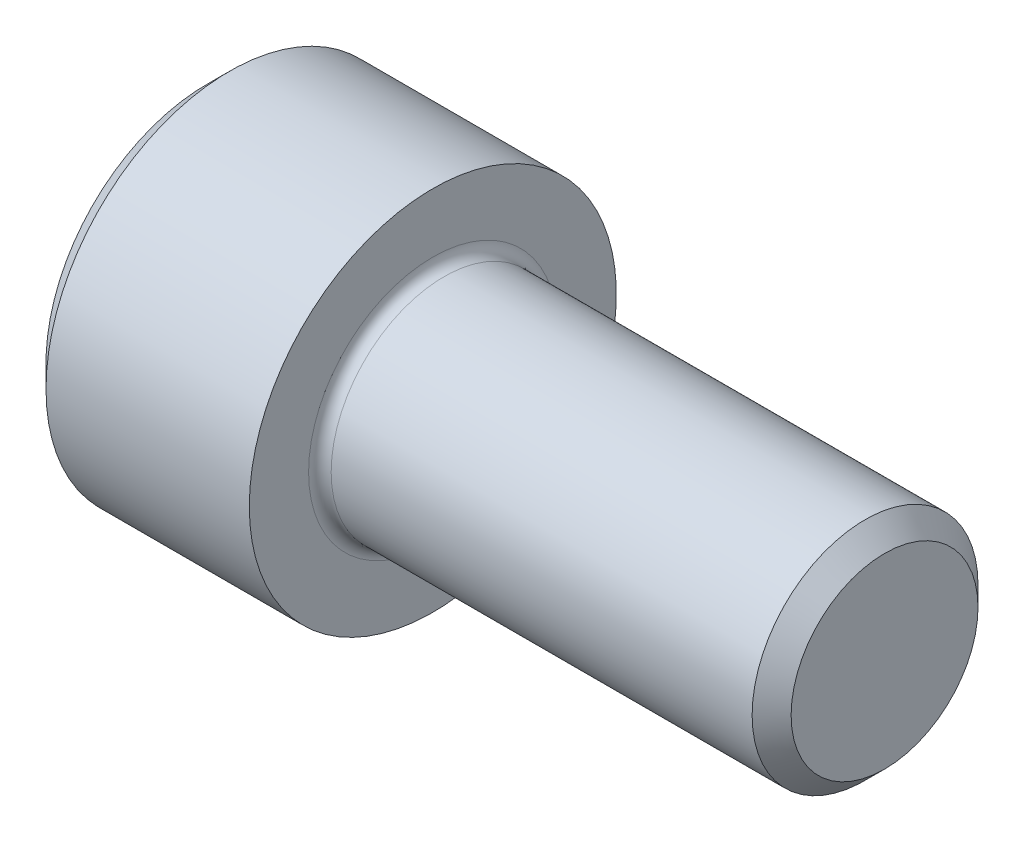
ISO-10303-21;
HEADER;
FILE_DESCRIPTION(('STEP AP214'),'2;1');
FILE_NAME('part.step','',(''),(''),'','','');
FILE_SCHEMA(('AUTOMOTIVE_DESIGN { 1 0 10303 214 1 1 1 1 }'));
ENDSEC;
DATA;
#1=APPLICATION_CONTEXT('core data for automotive mechanical design processes');
#2=APPLICATION_PROTOCOL_DEFINITION('international standard','automotive_design',2000,#1);
#3=PRODUCT_CONTEXT('',#1,'mechanical');
#4=PRODUCT('Part','Part','',(#3));
#5=PRODUCT_RELATED_PRODUCT_CATEGORY('part','',(#4));
#6=PRODUCT_DEFINITION_FORMATION('','',#4);
#7=PRODUCT_DEFINITION_CONTEXT('part definition',#1,'design');
#8=PRODUCT_DEFINITION('design','',#6,#7);
#9=PRODUCT_DEFINITION_SHAPE('','',#8);
#10=(LENGTH_UNIT() NAMED_UNIT(*) SI_UNIT(.MILLI.,.METRE.));
#11=(NAMED_UNIT(*) PLANE_ANGLE_UNIT() SI_UNIT($,.RADIAN.));
#12=(NAMED_UNIT(*) SI_UNIT($,.STERADIAN.) SOLID_ANGLE_UNIT());
#13=UNCERTAINTY_MEASURE_WITH_UNIT(LENGTH_MEASURE(1.E-05),#10,'distance_accuracy_value','');
#14=(GEOMETRIC_REPRESENTATION_CONTEXT(3) GLOBAL_UNCERTAINTY_ASSIGNED_CONTEXT((#13)) GLOBAL_UNIT_ASSIGNED_CONTEXT((#10,
#11,#12)) REPRESENTATION_CONTEXT('',''));
#15=CARTESIAN_POINT('',(0.,0.,0.));
#16=DIRECTION('',(0.,0.,1.));
#17=DIRECTION('',(1.,0.,0.));
#18=AXIS2_PLACEMENT_3D('',#15,#16,#17);
#19=CARTESIAN_POINT('',(24.,-3.349214,3.349214));
#20=DIRECTION('',(1.,0.,0.));
#21=DIRECTION('',(0.,0.,-1.));
#22=AXIS2_PLACEMENT_3D('',#19,#20,#21);
#23=PLANE('',#22);
#24=CARTESIAN_POINT('',(24.,0.,0.));
#25=DIRECTION('',(-1.,0.,0.));
#26=DIRECTION('',(0.,0.,1.));
#27=AXIS2_PLACEMENT_3D('',#24,#25,#26);
#28=CIRCLE('',#27,3.30949999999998);
#29=CARTESIAN_POINT('',(24.,0.,3.30949999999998));
#30=VERTEX_POINT('',#29);
#31=EDGE_CURVE('E20',#30,#30,#28,.F.);
#32=ORIENTED_EDGE('',*,*,#31,.T.);
#33=EDGE_LOOP('',(#32));
#34=FACE_BOUND('',#33,.T.);
#35=ADVANCED_FACE('F16',(#34),#23,.T.);
#36=CARTESIAN_POINT('',(24.,0.,0.));
#37=DIRECTION('',(-1.,0.,0.));
#38=DIRECTION('',(0.,0.,1.));
#39=AXIS2_PLACEMENT_3D('',#36,#37,#38);
#40=CONICAL_SURFACE('',#39,3.3095,0.785398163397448);
#41=CARTESIAN_POINT('',(23.3095,0.,0.));
#42=DIRECTION('',(-1.,0.,0.));
#43=DIRECTION('',(0.,0.,1.));
#44=AXIS2_PLACEMENT_3D('',#41,#42,#43);
#45=CIRCLE('',#44,4.);
#46=CARTESIAN_POINT('',(23.3095,0.,4.));
#47=VERTEX_POINT('',#46);
#48=EDGE_CURVE('E124',#47,#47,#45,.F.);
#49=ORIENTED_EDGE('',*,*,#48,.T.);
#50=EDGE_LOOP('',(#49));
#51=FACE_BOUND('',#50,.T.);
#52=ORIENTED_EDGE('',*,*,#31,.F.);
#53=EDGE_LOOP('',(#52));
#54=FACE_BOUND('',#53,.T.);
#55=ADVANCED_FACE('F254',(#51,#54),#40,.T.);
#56=CARTESIAN_POINT('',(23.3095,0.,0.));
#57=DIRECTION('',(-1.,0.,0.));
#58=DIRECTION('',(0.,0.,1.));
#59=AXIS2_PLACEMENT_3D('',#56,#57,#58);
#60=CYLINDRICAL_SURFACE('',#59,4.);
#61=CARTESIAN_POINT('',(8.40000000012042,0.,0.));
#62=DIRECTION('',(1.,0.,0.));
#63=DIRECTION('',(0.,0.,-1.));
#64=AXIS2_PLACEMENT_3D('',#61,#62,#63);
#65=CIRCLE('',#64,4.00000000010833);
#66=CARTESIAN_POINT('',(8.40000000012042,0.,-4.00000000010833));
#67=VERTEX_POINT('',#66);
#68=EDGE_CURVE('E120',#67,#67,#65,.T.);
#69=ORIENTED_EDGE('',*,*,#68,.T.);
#70=EDGE_LOOP('',(#69));
#71=FACE_BOUND('',#70,.T.);
#72=ORIENTED_EDGE('',*,*,#48,.F.);
#73=EDGE_LOOP('',(#72));
#74=FACE_BOUND('',#73,.T.);
#75=ADVANCED_FACE('F250',(#71,#74),#60,.T.);
#76=CARTESIAN_POINT('',(8.40000000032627,0.,0.));
#77=DIRECTION('',(1.,0.,0.));
#78=DIRECTION('',(0.,0.,-1.));
#79=AXIS2_PLACEMENT_3D('',#76,#77,#78);
#80=TOROIDAL_SURFACE('',#79,4.40000000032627,0.400000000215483);
#81=ORIENTED_EDGE('',*,*,#68,.F.);
#82=EDGE_LOOP('',(#81));
#83=FACE_BOUND('',#82,.T.);
#84=CARTESIAN_POINT('',(8.00000000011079,0.,0.));
#85=DIRECTION('',(1.,0.,0.));
#86=DIRECTION('',(0.,0.,-1.));
#87=AXIS2_PLACEMENT_3D('',#84,#85,#86);
#88=CIRCLE('',#87,4.400000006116);
#89=CARTESIAN_POINT('',(8.00000000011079,0.,-4.400000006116));
#90=VERTEX_POINT('',#89);
#91=EDGE_CURVE('E118',#90,#90,#88,.F.);
#92=ORIENTED_EDGE('',*,*,#91,.F.);
#93=EDGE_LOOP('',(#92));
#94=FACE_BOUND('',#93,.T.);
#95=ADVANCED_FACE('F253',(#83,#94),#80,.F.);
#96=CARTESIAN_POINT('',(8.,-6.578,6.578));
#97=DIRECTION('',(1.,0.,0.));
#98=DIRECTION('',(0.,0.,-1.));
#99=AXIS2_PLACEMENT_3D('',#96,#97,#98);
#100=PLANE('',#99);
#101=ORIENTED_EDGE('',*,*,#91,.T.);
#102=EDGE_LOOP('',(#101));
#103=FACE_BOUND('',#102,.T.);
#104=CARTESIAN_POINT('',(8.,0.,0.));
#105=DIRECTION('',(-1.,0.,0.));
#106=DIRECTION('',(0.,0.,1.));
#107=AXIS2_PLACEMENT_3D('',#104,#105,#106);
#108=CIRCLE('',#107,6.5);
#109=CARTESIAN_POINT('',(8.,0.,6.5));
#110=VERTEX_POINT('',#109);
#111=EDGE_CURVE('E116',#110,#110,#108,.F.);
#112=ORIENTED_EDGE('',*,*,#111,.T.);
#113=EDGE_LOOP('',(#112));
#114=FACE_BOUND('',#113,.T.);
#115=ADVANCED_FACE('F248',(#103,#114),#100,.T.);
#116=CARTESIAN_POINT('',(8.,0.,0.));
#117=DIRECTION('',(-1.,0.,0.));
#118=DIRECTION('',(0.,0.,1.));
#119=AXIS2_PLACEMENT_3D('',#116,#117,#118);
#120=CYLINDRICAL_SURFACE('',#119,6.5);
#121=CARTESIAN_POINT('',(0.799999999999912,0.,0.));
#122=DIRECTION('',(1.,0.,0.));
#123=DIRECTION('',(0.,0.,-1.));
#124=AXIS2_PLACEMENT_3D('',#121,#122,#123);
#125=CIRCLE('',#124,6.5);
#126=CARTESIAN_POINT('',(0.8,0.,-6.5));
#127=VERTEX_POINT('',#126);
#128=EDGE_CURVE('E93',#127,#127,#125,.T.);
#129=ORIENTED_EDGE('',*,*,#128,.T.);
#130=EDGE_LOOP('',(#129));
#131=FACE_BOUND('',#130,.T.);
#132=ORIENTED_EDGE('',*,*,#111,.F.);
#133=EDGE_LOOP('',(#132));
#134=FACE_BOUND('',#133,.T.);
#135=ADVANCED_FACE('F244',(#131,#134),#120,.T.);
#136=CARTESIAN_POINT('',(0.,0.,0.));
#137=DIRECTION('',(1.,0.,0.));
#138=DIRECTION('',(0.,0.,-1.));
#139=AXIS2_PLACEMENT_3D('',#136,#137,#138);
#140=CONICAL_SURFACE('',#139,5.7,0.785398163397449);
#141=ORIENTED_EDGE('',*,*,#128,.F.);
#142=EDGE_LOOP('',(#141));
#143=FACE_BOUND('',#142,.T.);
#144=CARTESIAN_POINT('',(0.,0.,0.));
#145=DIRECTION('',(1.,0.,0.));
#146=DIRECTION('',(0.,0.,-1.));
#147=AXIS2_PLACEMENT_3D('',#144,#145,#146);
#148=CIRCLE('',#147,5.7);
#149=CARTESIAN_POINT('',(0.,0.,-5.7));
#150=VERTEX_POINT('',#149);
#151=EDGE_CURVE('E92',#150,#150,#148,.F.);
#152=ORIENTED_EDGE('',*,*,#151,.F.);
#153=EDGE_LOOP('',(#152));
#154=FACE_BOUND('',#153,.T.);
#155=ADVANCED_FACE('F241',(#143,#154),#140,.T.);
#156=CARTESIAN_POINT('',(0.,1.759474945,-3.0475));
#157=DIRECTION('',(0.,0.866025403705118,-0.500000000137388));
#158=DIRECTION('',(0.,0.500000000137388,0.866025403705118));
#159=AXIS2_PLACEMENT_3D('',#156,#157,#158);
#160=PLANE('',#159);
#161=DIRECTION('',(1.,0.,0.));
#162=VECTOR('',#161,1.);
#163=CARTESIAN_POINT('',(2.,1.759474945,-3.0475));
#164=LINE('',#163,#162);
#165=CARTESIAN_POINT('',(0.,1.75947494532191,-3.0475));
#166=VERTEX_POINT('',#165);
#167=CARTESIAN_POINT('',(4.,1.759474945,-3.0475));
#168=VERTEX_POINT('',#167);
#169=EDGE_CURVE('E159',#166,#168,#164,.T.);
#170=ORIENTED_EDGE('',*,*,#169,.T.);
#171=DIRECTION('',(0.,0.500000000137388,0.866025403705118));
#172=VECTOR('',#171,1.);
#173=CARTESIAN_POINT('',(4.,1.759474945,-3.0475));
#174=LINE('',#173,#172);
#175=CARTESIAN_POINT('',(4.,2.63921241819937,-1.52374999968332));
#176=VERTEX_POINT('',#175);
#177=EDGE_CURVE('E157',#168,#176,#174,.T.);
#178=ORIENTED_EDGE('',*,*,#177,.T.);
#179=DIRECTION('',(0.,0.500000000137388,0.866025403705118));
#180=VECTOR('',#179,1.);
#181=CARTESIAN_POINT('',(4.,1.759474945,-3.0475));
#182=LINE('',#181,#180);
#183=CARTESIAN_POINT('',(4.,3.518949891,0.));
#184=VERTEX_POINT('',#183);
#185=EDGE_CURVE('E87',#176,#184,#182,.T.);
#186=ORIENTED_EDGE('',*,*,#185,.T.);
#187=DIRECTION('',(1.,0.,0.));
#188=VECTOR('',#187,1.);
#189=CARTESIAN_POINT('',(2.,3.518949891,0.));
#190=LINE('',#189,#188);
#191=CARTESIAN_POINT('',(0.,3.5189498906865,-4.93629063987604E-11));
#192=VERTEX_POINT('',#191);
#193=EDGE_CURVE('E80',#192,#184,#190,.T.);
#194=ORIENTED_EDGE('',*,*,#193,.F.);
#195=DIRECTION('',(0.,0.499999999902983,0.866025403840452));
#196=VECTOR('',#195,1.);
#197=CARTESIAN_POINT('',(0.,1.759474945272,-3.047500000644));
#198=LINE('',#197,#196);
#199=EDGE_CURVE('E84',#166,#192,#198,.T.);
#200=ORIENTED_EDGE('',*,*,#199,.F.);
#201=EDGE_LOOP('',(#170,#178,#186,#194,#200));
#202=FACE_BOUND('',#201,.T.);
#203=ADVANCED_FACE('F83',(#202),#160,.F.);
#204=CARTESIAN_POINT('',(0.,1.759474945,3.0475));
#205=DIRECTION('',(0.,-0.866025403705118,-0.500000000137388));
#206=DIRECTION('',(0.,0.500000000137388,-0.866025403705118));
#207=AXIS2_PLACEMENT_3D('',#204,#205,#206);
#208=PLANE('',#207);
#209=DIRECTION('',(0.,0.500000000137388,-0.866025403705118));
#210=VECTOR('',#209,1.);
#211=CARTESIAN_POINT('',(4.,1.759474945,3.0475));
#212=LINE('',#211,#210);
#213=CARTESIAN_POINT('',(4.,2.63921241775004,1.52375000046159));
#214=VERTEX_POINT('',#213);
#215=CARTESIAN_POINT('',(4.,1.759474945,3.0475));
#216=VERTEX_POINT('',#215);
#217=EDGE_CURVE('E105',#214,#216,#212,.F.);
#218=ORIENTED_EDGE('',*,*,#217,.T.);
#219=DIRECTION('',(-1.,0.,0.));
#220=VECTOR('',#219,1.);
#221=CARTESIAN_POINT('',(2.,1.759474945,3.0475));
#222=LINE('',#221,#220);
#223=CARTESIAN_POINT('',(0.,1.75947494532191,3.0475));
#224=VERTEX_POINT('',#223);
#225=EDGE_CURVE('E110',#216,#224,#222,.T.);
#226=ORIENTED_EDGE('',*,*,#225,.T.);
#227=DIRECTION('',(0.,-0.499999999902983,0.866025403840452));
#228=VECTOR('',#227,1.);
#229=CARTESIAN_POINT('',(0.,3.518949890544,0.));
#230=LINE('',#229,#228);
#231=EDGE_CURVE('E100',#192,#224,#230,.T.);
#232=ORIENTED_EDGE('',*,*,#231,.F.);
#233=ORIENTED_EDGE('',*,*,#193,.T.);
#234=DIRECTION('',(0.,0.500000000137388,-0.866025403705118));
#235=VECTOR('',#234,1.);
#236=CARTESIAN_POINT('',(4.,1.759474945,3.0475));
#237=LINE('',#236,#235);
#238=EDGE_CURVE('E160',#184,#214,#237,.F.);
#239=ORIENTED_EDGE('',*,*,#238,.T.);
#240=EDGE_LOOP('',(#218,#226,#232,#233,#239));
#241=FACE_BOUND('',#240,.T.);
#242=ADVANCED_FACE('F108',(#241),#208,.T.);
#243=CARTESIAN_POINT('',(0.,-5.7684,-5.7684));
#244=DIRECTION('',(-1.,0.,0.));
#245=DIRECTION('',(0.,0.,1.));
#246=AXIS2_PLACEMENT_3D('',#243,#244,#245);
#247=PLANE('',#246);
#248=DIRECTION('',(0.,1.,0.));
#249=VECTOR('',#248,1.);
#250=CARTESIAN_POINT('',(0.,0.,-3.0475));
#251=LINE('',#250,#249);
#252=CARTESIAN_POINT('',(0.,-1.759474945,-3.0475));
#253=VERTEX_POINT('',#252);
#254=EDGE_CURVE('E104',#253,#166,#251,.T.);
#255=ORIENTED_EDGE('',*,*,#254,.T.);
#256=ORIENTED_EDGE('',*,*,#199,.T.);
#257=ORIENTED_EDGE('',*,*,#231,.T.);
#258=DIRECTION('',(0.,-1.,0.));
#259=VECTOR('',#258,1.);
#260=CARTESIAN_POINT('',(0.,0.,3.0475));
#261=LINE('',#260,#259);
#262=CARTESIAN_POINT('',(0.,-1.759474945,3.0475));
#263=VERTEX_POINT('',#262);
#264=EDGE_CURVE('E172',#224,#263,#261,.T.);
#265=ORIENTED_EDGE('',*,*,#264,.T.);
#266=DIRECTION('',(0.,0.500000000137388,0.866025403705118));
#267=VECTOR('',#266,1.);
#268=CARTESIAN_POINT('',(0.,-2.639212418,1.52375));
#269=LINE('',#268,#267);
#270=CARTESIAN_POINT('',(0.,-3.518949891,0.));
#271=VERTEX_POINT('',#270);
#272=EDGE_CURVE('E198',#271,#263,#269,.T.);
#273=ORIENTED_EDGE('',*,*,#272,.F.);
#274=DIRECTION('',(0.,-0.500000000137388,0.866025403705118));
#275=VECTOR('',#274,1.);
#276=CARTESIAN_POINT('',(0.,-2.639212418,-1.52375));
#277=LINE('',#276,#275);
#278=EDGE_CURVE('E178',#253,#271,#277,.T.);
#279=ORIENTED_EDGE('',*,*,#278,.F.);
#280=EDGE_LOOP('',(#255,#256,#257,#265,#273,#279));
#281=FACE_BOUND('',#280,.T.);
#282=ORIENTED_EDGE('',*,*,#151,.T.);
#283=EDGE_LOOP('',(#282));
#284=FACE_BOUND('',#283,.T.);
#285=ADVANCED_FACE('F97',(#281,#284),#247,.T.);
#286=CARTESIAN_POINT('',(4.,-0.015835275,3.0475));
#287=DIRECTION('',(1.,0.,0.));
#288=DIRECTION('',(0.,0.,-1.));
#289=AXIS2_PLACEMENT_3D('',#286,#287,#288);
#290=PLANE('',#289);
#291=ORIENTED_EDGE('',*,*,#217,.F.);
#292=CARTESIAN_POINT('',(4.,0.,0.));
#293=DIRECTION('',(-1.,0.,0.));
#294=DIRECTION('',(0.,0.,1.));
#295=AXIS2_PLACEMENT_3D('',#292,#293,#294);
#296=CIRCLE('',#295,3.0475);
#297=CARTESIAN_POINT('',(4.,-2.73646157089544E-10,3.0475));
#298=VERTEX_POINT('',#297);
#299=EDGE_CURVE('E153',#298,#214,#296,.T.);
#300=ORIENTED_EDGE('',*,*,#299,.F.);
#301=DIRECTION('',(0.,1.,0.));
#302=VECTOR('',#301,1.);
#303=CARTESIAN_POINT('',(4.,0.,3.0475));
#304=LINE('',#303,#302);
#305=EDGE_CURVE('E169',#298,#216,#304,.T.);
#306=ORIENTED_EDGE('',*,*,#305,.T.);
#307=EDGE_LOOP('',(#291,#300,#306));
#308=FACE_BOUND('',#307,.T.);
#309=ADVANCED_FACE('F174',(#308),#290,.F.);
#310=CARTESIAN_POINT('',(4.,2.633933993,1.542035));
#311=DIRECTION('',(1.,0.,0.));
#312=DIRECTION('',(0.,0.,-1.));
#313=AXIS2_PLACEMENT_3D('',#310,#311,#312);
#314=PLANE('',#313);
#315=ORIENTED_EDGE('',*,*,#185,.F.);
#316=CARTESIAN_POINT('',(4.,0.,0.));
#317=DIRECTION('',(-1.,0.,0.));
#318=DIRECTION('',(0.,0.,1.));
#319=AXIS2_PLACEMENT_3D('',#316,#317,#318);
#320=CIRCLE('',#319,3.0475);
#321=EDGE_CURVE('E150',#214,#176,#320,.T.);
#322=ORIENTED_EDGE('',*,*,#321,.F.);
#323=ORIENTED_EDGE('',*,*,#238,.F.);
#324=EDGE_LOOP('',(#315,#322,#323));
#325=FACE_BOUND('',#324,.T.);
#326=ADVANCED_FACE('F221',(#325),#314,.F.);
#327=CARTESIAN_POINT('',(4.,-0.015835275,-1.5146075));
#328=DIRECTION('',(1.,0.,0.));
#329=DIRECTION('',(0.,0.,-1.));
#330=AXIS2_PLACEMENT_3D('',#327,#328,#329);
#331=PLANE('',#330);
#332=DIRECTION('',(0.,-1.,0.));
#333=VECTOR('',#332,1.);
#334=CARTESIAN_POINT('',(4.,0.,-3.0475));
#335=LINE('',#334,#333);
#336=CARTESIAN_POINT('',(4.,-6.2505282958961E-10,-3.0475));
#337=VERTEX_POINT('',#336);
#338=EDGE_CURVE('E189',#168,#337,#335,.T.);
#339=ORIENTED_EDGE('',*,*,#338,.T.);
#340=CARTESIAN_POINT('',(4.,0.,0.));
#341=DIRECTION('',(-1.,0.,0.));
#342=DIRECTION('',(0.,0.,1.));
#343=AXIS2_PLACEMENT_3D('',#340,#341,#342);
#344=CIRCLE('',#343,3.0475);
#345=EDGE_CURVE('E148',#176,#337,#344,.T.);
#346=ORIENTED_EDGE('',*,*,#345,.F.);
#347=ORIENTED_EDGE('',*,*,#177,.F.);
#348=EDGE_LOOP('',(#339,#346,#347));
#349=FACE_BOUND('',#348,.T.);
#350=ADVANCED_FACE('F217',(#349),#331,.F.);
#351=CARTESIAN_POINT('',(0.,-1.759474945,-3.0475));
#352=DIRECTION('',(0.,0.,-1.));
#353=DIRECTION('',(0.,1.,0.));
#354=AXIS2_PLACEMENT_3D('',#351,#352,#353);
#355=PLANE('',#354);
#356=DIRECTION('',(-1.,0.,0.));
#357=VECTOR('',#356,1.);
#358=CARTESIAN_POINT('',(2.,-1.759474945,-3.0475));
#359=LINE('',#358,#357);
#360=CARTESIAN_POINT('',(4.,-1.759474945,-3.0475));
#361=VERTEX_POINT('',#360);
#362=EDGE_CURVE('E175',#361,#253,#359,.T.);
#363=ORIENTED_EDGE('',*,*,#362,.F.);
#364=DIRECTION('',(0.,1.,0.));
#365=VECTOR('',#364,1.);
#366=CARTESIAN_POINT('',(4.,-1.319606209,-3.0475));
#367=LINE('',#366,#365);
#368=EDGE_CURVE('E144',#361,#337,#367,.T.);
#369=ORIENTED_EDGE('',*,*,#368,.T.);
#370=ORIENTED_EDGE('',*,*,#338,.F.);
#371=ORIENTED_EDGE('',*,*,#169,.F.);
#372=ORIENTED_EDGE('',*,*,#254,.F.);
#373=EDGE_LOOP('',(#363,#369,#370,#371,#372));
#374=FACE_BOUND('',#373,.T.);
#375=ADVANCED_FACE('F212',(#374),#355,.F.);
#376=CARTESIAN_POINT('',(0.,-1.759474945,-3.0475));
#377=DIRECTION('',(0.,0.866025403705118,0.500000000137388));
#378=DIRECTION('',(0.,-0.500000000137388,0.866025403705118));
#379=AXIS2_PLACEMENT_3D('',#376,#377,#378);
#380=PLANE('',#379);
#381=DIRECTION('',(0.,-0.500000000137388,0.866025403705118));
#382=VECTOR('',#381,1.);
#383=CARTESIAN_POINT('',(4.,-1.759474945,-3.0475));
#384=LINE('',#383,#382);
#385=CARTESIAN_POINT('',(4.,-2.63921241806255,-1.5237499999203));
#386=VERTEX_POINT('',#385);
#387=EDGE_CURVE('E145',#386,#361,#384,.F.);
#388=ORIENTED_EDGE('',*,*,#387,.T.);
#389=ORIENTED_EDGE('',*,*,#362,.T.);
#390=ORIENTED_EDGE('',*,*,#278,.T.);
#391=DIRECTION('',(-1.,0.,0.));
#392=VECTOR('',#391,1.);
#393=CARTESIAN_POINT('',(2.,-3.518949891,0.));
#394=LINE('',#393,#392);
#395=CARTESIAN_POINT('',(4.,-3.518949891,0.));
#396=VERTEX_POINT('',#395);
#397=EDGE_CURVE('E156',#396,#271,#394,.T.);
#398=ORIENTED_EDGE('',*,*,#397,.F.);
#399=DIRECTION('',(0.,-0.500000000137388,0.866025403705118));
#400=VECTOR('',#399,1.);
#401=CARTESIAN_POINT('',(4.,-1.759474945,-3.0475));
#402=LINE('',#401,#400);
#403=EDGE_CURVE('E140',#396,#386,#402,.F.);
#404=ORIENTED_EDGE('',*,*,#403,.T.);
#405=EDGE_LOOP('',(#388,#389,#390,#398,#404));
#406=FACE_BOUND('',#405,.T.);
#407=ADVANCED_FACE('F297',(#406),#380,.T.);
#408=CARTESIAN_POINT('',(0.,1.759474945,3.0475));
#409=DIRECTION('',(0.,0.,1.));
#410=DIRECTION('',(0.,-1.,0.));
#411=AXIS2_PLACEMENT_3D('',#408,#409,#410);
#412=PLANE('',#411);
#413=ORIENTED_EDGE('',*,*,#225,.F.);
#414=ORIENTED_EDGE('',*,*,#305,.F.);
#415=DIRECTION('',(0.,-1.,0.));
#416=VECTOR('',#415,1.);
#417=CARTESIAN_POINT('',(4.,-1.319606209,3.0475));
#418=LINE('',#417,#416);
#419=CARTESIAN_POINT('',(4.,-1.759474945,3.0475));
#420=VERTEX_POINT('',#419);
#421=EDGE_CURVE('E139',#298,#420,#418,.T.);
#422=ORIENTED_EDGE('',*,*,#421,.T.);
#423=DIRECTION('',(1.,0.,0.));
#424=VECTOR('',#423,1.);
#425=CARTESIAN_POINT('',(2.,-1.759474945,3.0475));
#426=LINE('',#425,#424);
#427=EDGE_CURVE('E186',#263,#420,#426,.T.);
#428=ORIENTED_EDGE('',*,*,#427,.F.);
#429=ORIENTED_EDGE('',*,*,#264,.F.);
#430=EDGE_LOOP('',(#413,#414,#422,#428,#429));
#431=FACE_BOUND('',#430,.T.);
#432=ADVANCED_FACE('F167',(#431),#412,.F.);
#433=CARTESIAN_POINT('',(0.,-3.518949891,0.));
#434=DIRECTION('',(0.,0.866025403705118,-0.500000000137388));
#435=DIRECTION('',(0.,0.500000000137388,0.866025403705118));
#436=AXIS2_PLACEMENT_3D('',#433,#434,#435);
#437=PLANE('',#436);
#438=DIRECTION('',(0.,0.500000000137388,0.866025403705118));
#439=VECTOR('',#438,1.);
#440=CARTESIAN_POINT('',(4.,-3.518949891,0.));
#441=LINE('',#440,#439);
#442=CARTESIAN_POINT('',(4.,-2.63921241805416,1.52374999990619));
#443=VERTEX_POINT('',#442);
#444=EDGE_CURVE('E35',#443,#396,#441,.F.);
#445=ORIENTED_EDGE('',*,*,#444,.T.);
#446=ORIENTED_EDGE('',*,*,#397,.T.);
#447=ORIENTED_EDGE('',*,*,#272,.T.);
#448=ORIENTED_EDGE('',*,*,#427,.T.);
#449=DIRECTION('',(0.,0.500000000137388,0.866025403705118));
#450=VECTOR('',#449,1.);
#451=CARTESIAN_POINT('',(4.,-3.518949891,0.));
#452=LINE('',#451,#450);
#453=EDGE_CURVE('E136',#420,#443,#452,.F.);
#454=ORIENTED_EDGE('',*,*,#453,.T.);
#455=EDGE_LOOP('',(#445,#446,#447,#448,#454));
#456=FACE_BOUND('',#455,.T.);
#457=ADVANCED_FACE('F311',(#456),#437,.T.);
#458=CARTESIAN_POINT('',(4.,-2.655047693,-1.5146075));
#459=DIRECTION('',(1.,0.,0.));
#460=DIRECTION('',(0.,0.,-1.));
#461=AXIS2_PLACEMENT_3D('',#458,#459,#460);
#462=PLANE('',#461);
#463=ORIENTED_EDGE('',*,*,#387,.F.);
#464=CARTESIAN_POINT('',(4.,0.,0.));
#465=DIRECTION('',(-1.,0.,0.));
#466=DIRECTION('',(0.,0.,1.));
#467=AXIS2_PLACEMENT_3D('',#464,#465,#466);
#468=CIRCLE('',#467,3.0475);
#469=EDGE_CURVE('E133',#337,#386,#468,.T.);
#470=ORIENTED_EDGE('',*,*,#469,.F.);
#471=ORIENTED_EDGE('',*,*,#368,.F.);
#472=EDGE_LOOP('',(#463,#470,#471));
#473=FACE_BOUND('',#472,.T.);
#474=ADVANCED_FACE('F318',(#473),#462,.F.);
#475=CARTESIAN_POINT('',(4.,-3.524228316,1.542035));
#476=DIRECTION('',(1.,0.,0.));
#477=DIRECTION('',(0.,0.,-1.));
#478=AXIS2_PLACEMENT_3D('',#475,#476,#477);
#479=PLANE('',#478);
#480=ORIENTED_EDGE('',*,*,#444,.F.);
#481=CARTESIAN_POINT('',(4.,0.,0.));
#482=DIRECTION('',(-1.,0.,0.));
#483=DIRECTION('',(0.,0.,1.));
#484=AXIS2_PLACEMENT_3D('',#481,#482,#483);
#485=CIRCLE('',#484,3.0475);
#486=EDGE_CURVE('E26',#386,#443,#485,.T.);
#487=ORIENTED_EDGE('',*,*,#486,.F.);
#488=ORIENTED_EDGE('',*,*,#403,.F.);
#489=EDGE_LOOP('',(#480,#487,#488));
#490=FACE_BOUND('',#489,.T.);
#491=ADVANCED_FACE('F237',(#490),#479,.F.);
#492=CARTESIAN_POINT('',(4.,-2.655047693,3.0475));
#493=DIRECTION('',(1.,0.,0.));
#494=DIRECTION('',(0.,0.,-1.));
#495=AXIS2_PLACEMENT_3D('',#492,#493,#494);
#496=PLANE('',#495);
#497=ORIENTED_EDGE('',*,*,#421,.F.);
#498=CARTESIAN_POINT('',(4.,0.,0.));
#499=DIRECTION('',(-1.,0.,0.));
#500=DIRECTION('',(0.,0.,1.));
#501=AXIS2_PLACEMENT_3D('',#498,#499,#500);
#502=CIRCLE('',#501,3.0475);
#503=EDGE_CURVE('E10',#443,#298,#502,.T.);
#504=ORIENTED_EDGE('',*,*,#503,.F.);
#505=ORIENTED_EDGE('',*,*,#453,.F.);
#506=EDGE_LOOP('',(#497,#504,#505));
#507=FACE_BOUND('',#506,.T.);
#508=ADVANCED_FACE('F18',(#507),#496,.F.);
#509=CARTESIAN_POINT('',(5.759474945,0.,0.));
#510=DIRECTION('',(-1.,0.,0.));
#511=DIRECTION('',(0.,0.,1.));
#512=AXIS2_PLACEMENT_3D('',#509,#510,#511);
#513=CONICAL_SURFACE('',#512,0.,1.04719755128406);
#514=CARTESIAN_POINT('',(5.759474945,0.,0.));
#515=VERTEX_POINT('',#514);
#516=VERTEX_LOOP('',#515);
#517=FACE_BOUND('',#516,.T.);
#518=ORIENTED_EDGE('',*,*,#486,.T.);
#519=ORIENTED_EDGE('',*,*,#503,.T.);
#520=ORIENTED_EDGE('',*,*,#299,.T.);
#521=ORIENTED_EDGE('',*,*,#321,.T.);
#522=ORIENTED_EDGE('',*,*,#345,.T.);
#523=ORIENTED_EDGE('',*,*,#469,.T.);
#524=EDGE_LOOP('',(#518,#519,#520,#521,#522,#523));
#525=FACE_BOUND('',#524,.T.);
#526=ADVANCED_FACE('F219',(#517,#525),#513,.F.);
#527=CLOSED_SHELL('',(#35,#55,#75,#95,#115,#135,#155,#203,#242,#285,#309,#326,#350,#375,#407,
#432,#457,#474,#491,#508,#526));
#528=MANIFOLD_SOLID_BREP('B1',#527);
#529=ADVANCED_BREP_SHAPE_REPRESENTATION('',(#18,#528),#14);
#530=SHAPE_DEFINITION_REPRESENTATION(#9,#529);
ENDSEC;
END-ISO-10303-21;
